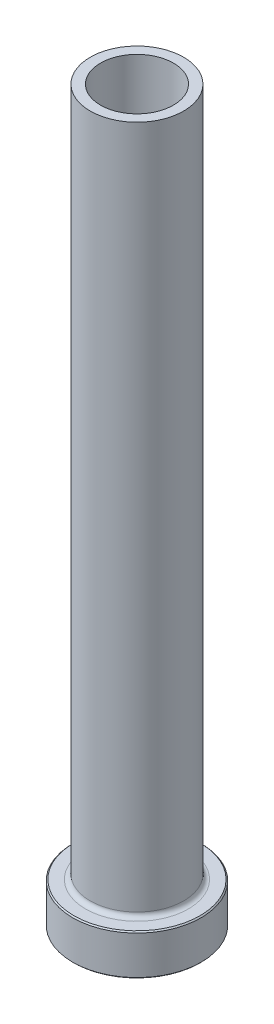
ISO-10303-21;
HEADER;
FILE_DESCRIPTION(('STEP AP214'),'2;1');
FILE_NAME('part.step','',(''),(''),'','','');
FILE_SCHEMA(('AUTOMOTIVE_DESIGN { 1 0 10303 214 1 1 1 1 }'));
ENDSEC;
DATA;
#1=APPLICATION_CONTEXT('core data for automotive mechanical design processes');
#2=APPLICATION_PROTOCOL_DEFINITION('international standard','automotive_design',2000,#1);
#3=PRODUCT_CONTEXT('',#1,'mechanical');
#4=PRODUCT('Part','Part','',(#3));
#5=PRODUCT_RELATED_PRODUCT_CATEGORY('part','',(#4));
#6=PRODUCT_DEFINITION_FORMATION('','',#4);
#7=PRODUCT_DEFINITION_CONTEXT('part definition',#1,'design');
#8=PRODUCT_DEFINITION('design','',#6,#7);
#9=PRODUCT_DEFINITION_SHAPE('','',#8);
#10=(LENGTH_UNIT() NAMED_UNIT(*) SI_UNIT(.MILLI.,.METRE.));
#11=(NAMED_UNIT(*) PLANE_ANGLE_UNIT() SI_UNIT($,.RADIAN.));
#12=(NAMED_UNIT(*) SI_UNIT($,.STERADIAN.) SOLID_ANGLE_UNIT());
#13=UNCERTAINTY_MEASURE_WITH_UNIT(LENGTH_MEASURE(1.E-05),#10,'distance_accuracy_value','');
#14=(GEOMETRIC_REPRESENTATION_CONTEXT(3) GLOBAL_UNCERTAINTY_ASSIGNED_CONTEXT((#13)) GLOBAL_UNIT_ASSIGNED_CONTEXT((#10,
#11,#12)) REPRESENTATION_CONTEXT('',''));
#15=CARTESIAN_POINT('',(0.,0.,0.));
#16=DIRECTION('',(0.,0.,1.));
#17=DIRECTION('',(1.,0.,0.));
#18=AXIS2_PLACEMENT_3D('',#15,#16,#17);
#19=CARTESIAN_POINT('',(0.,92.1876809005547,0.));
#20=DIRECTION('',(0.,1.,0.));
#21=DIRECTION('',(0.,0.,1.));
#22=AXIS2_PLACEMENT_3D('',#19,#20,#21);
#23=CYLINDRICAL_SURFACE('',#22,6.24999999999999);
#24=CARTESIAN_POINT('',(0.,125.,0.));
#25=DIRECTION('',(0.,1.,0.));
#26=DIRECTION('',(0.,0.,1.));
#27=AXIS2_PLACEMENT_3D('',#24,#25,#26);
#28=CIRCLE('',#27,6.24999999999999);
#29=CARTESIAN_POINT('',(0.,125.,6.24999999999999));
#30=VERTEX_POINT('',#29);
#31=EDGE_CURVE('E62',#30,#30,#28,.T.);
#32=ORIENTED_EDGE('',*,*,#31,.T.);
#33=EDGE_LOOP('',(#32));
#34=FACE_BOUND('',#33,.T.);
#35=CARTESIAN_POINT('',(0.,70.,0.));
#36=DIRECTION('',(0.,1.,0.));
#37=DIRECTION('',(0.,0.,1.));
#38=AXIS2_PLACEMENT_3D('',#35,#36,#37);
#39=CIRCLE('',#38,6.24999999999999);
#40=CARTESIAN_POINT('',(0.,70.,6.24999999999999));
#41=VERTEX_POINT('',#40);
#42=EDGE_CURVE('E71',#41,#41,#39,.T.);
#43=ORIENTED_EDGE('',*,*,#42,.F.);
#44=EDGE_LOOP('',(#43));
#45=FACE_BOUND('',#44,.T.);
#46=ADVANCED_FACE('F30',(#34,#45),#23,.F.);
#47=CARTESIAN_POINT('',(-6.24999999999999,125.,0.));
#48=DIRECTION('',(0.,1.,0.));
#49=DIRECTION('',(0.,0.,1.));
#50=AXIS2_PLACEMENT_3D('',#47,#48,#49);
#51=PLANE('',#50);
#52=CARTESIAN_POINT('',(0.,125.,0.));
#53=DIRECTION('',(0.,1.,0.));
#54=DIRECTION('',(0.,0.,1.));
#55=AXIS2_PLACEMENT_3D('',#52,#53,#54);
#56=CIRCLE('',#55,8.);
#57=CARTESIAN_POINT('',(0.,125.,8.));
#58=VERTEX_POINT('',#57);
#59=EDGE_CURVE('E65',#58,#58,#56,.T.);
#60=ORIENTED_EDGE('',*,*,#59,.T.);
#61=EDGE_LOOP('',(#60));
#62=FACE_BOUND('',#61,.T.);
#63=ORIENTED_EDGE('',*,*,#31,.F.);
#64=EDGE_LOOP('',(#63));
#65=FACE_BOUND('',#64,.T.);
#66=ADVANCED_FACE('F79',(#62,#65),#51,.T.);
#67=CARTESIAN_POINT('',(0.,92.1876809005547,0.));
#68=DIRECTION('',(0.,1.,0.));
#69=DIRECTION('',(0.,0.,1.));
#70=AXIS2_PLACEMENT_3D('',#67,#68,#69);
#71=CYLINDRICAL_SURFACE('',#70,8.);
#72=CARTESIAN_POINT('',(0.,7.8,0.));
#73=DIRECTION('',(0.,1.,0.));
#74=DIRECTION('',(0.,0.,1.));
#75=AXIS2_PLACEMENT_3D('',#72,#73,#74);
#76=CIRCLE('',#75,8.);
#77=CARTESIAN_POINT('',(0.,7.8,8.));
#78=VERTEX_POINT('',#77);
#79=EDGE_CURVE('E59',#78,#78,#76,.T.);
#80=ORIENTED_EDGE('',*,*,#79,.T.);
#81=EDGE_LOOP('',(#80));
#82=FACE_BOUND('',#81,.T.);
#83=ORIENTED_EDGE('',*,*,#59,.F.);
#84=EDGE_LOOP('',(#83));
#85=FACE_BOUND('',#84,.T.);
#86=ADVANCED_FACE('F85',(#82,#85),#71,.T.);
#87=CARTESIAN_POINT('',(-7.99999999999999,7.,0.));
#88=DIRECTION('',(0.,1.,0.));
#89=DIRECTION('',(0.,0.,1.));
#90=AXIS2_PLACEMENT_3D('',#87,#88,#89);
#91=PLANE('',#90);
#92=CARTESIAN_POINT('',(0.,7.,0.));
#93=DIRECTION('',(0.,1.,0.));
#94=DIRECTION('',(0.,0.,1.));
#95=AXIS2_PLACEMENT_3D('',#92,#93,#94);
#96=CIRCLE('',#95,10.8);
#97=CARTESIAN_POINT('',(0.,7.,10.8));
#98=VERTEX_POINT('',#97);
#99=EDGE_CURVE('E53',#98,#98,#96,.T.);
#100=ORIENTED_EDGE('',*,*,#99,.T.);
#101=EDGE_LOOP('',(#100));
#102=FACE_BOUND('',#101,.T.);
#103=CARTESIAN_POINT('',(0.,7.,0.));
#104=DIRECTION('',(0.,1.,0.));
#105=DIRECTION('',(0.,0.,1.));
#106=AXIS2_PLACEMENT_3D('',#103,#104,#105);
#107=CIRCLE('',#106,8.8);
#108=CARTESIAN_POINT('',(0.,7.,8.8));
#109=VERTEX_POINT('',#108);
#110=EDGE_CURVE('E56',#109,#109,#107,.F.);
#111=ORIENTED_EDGE('',*,*,#110,.T.);
#112=EDGE_LOOP('',(#111));
#113=FACE_BOUND('',#112,.T.);
#114=ADVANCED_FACE('F111',(#102,#113),#91,.T.);
#115=CARTESIAN_POINT('',(0.,92.1876809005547,0.));
#116=DIRECTION('',(0.,1.,0.));
#117=DIRECTION('',(0.,0.,1.));
#118=AXIS2_PLACEMENT_3D('',#115,#116,#117);
#119=CYLINDRICAL_SURFACE('',#118,11.);
#120=CARTESIAN_POINT('',(0.,6.80000000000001,0.));
#121=DIRECTION('',(0.,1.,0.));
#122=DIRECTION('',(0.,0.,1.));
#123=AXIS2_PLACEMENT_3D('',#120,#121,#122);
#124=CIRCLE('',#123,11.);
#125=CARTESIAN_POINT('',(0.,6.80000000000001,11.));
#126=VERTEX_POINT('',#125);
#127=EDGE_CURVE('E45',#126,#126,#124,.F.);
#128=ORIENTED_EDGE('',*,*,#127,.T.);
#129=EDGE_LOOP('',(#128));
#130=FACE_BOUND('',#129,.T.);
#131=CARTESIAN_POINT('',(0.,0.20000000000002,0.));
#132=DIRECTION('',(0.,-1.,0.));
#133=DIRECTION('',(0.,0.,-1.));
#134=AXIS2_PLACEMENT_3D('',#131,#132,#133);
#135=CIRCLE('',#134,11.);
#136=CARTESIAN_POINT('',(0.,0.20000000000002,-11.));
#137=VERTEX_POINT('',#136);
#138=EDGE_CURVE('E50',#137,#137,#135,.F.);
#139=ORIENTED_EDGE('',*,*,#138,.T.);
#140=EDGE_LOOP('',(#139));
#141=FACE_BOUND('',#140,.T.);
#142=ADVANCED_FACE('F108',(#130,#141),#119,.T.);
#143=CARTESIAN_POINT('',(-11.,0.,0.));
#144=DIRECTION('',(0.,-1.,0.));
#145=DIRECTION('',(0.,0.,-1.));
#146=AXIS2_PLACEMENT_3D('',#143,#144,#145);
#147=PLANE('',#146);
#148=CARTESIAN_POINT('',(0.,0.,0.));
#149=DIRECTION('',(0.,-1.,0.));
#150=DIRECTION('',(0.,0.,-1.));
#151=AXIS2_PLACEMENT_3D('',#148,#149,#150);
#152=CIRCLE('',#151,6.99999999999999);
#153=CARTESIAN_POINT('',(0.,0.,-6.99999999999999));
#154=VERTEX_POINT('',#153);
#155=EDGE_CURVE('E37',#154,#154,#152,.F.);
#156=ORIENTED_EDGE('',*,*,#155,.T.);
#157=EDGE_LOOP('',(#156));
#158=FACE_BOUND('',#157,.T.);
#159=CARTESIAN_POINT('',(0.,0.,0.));
#160=DIRECTION('',(0.,-1.,0.));
#161=DIRECTION('',(0.,0.,-1.));
#162=AXIS2_PLACEMENT_3D('',#159,#160,#161);
#163=CIRCLE('',#162,10.8);
#164=CARTESIAN_POINT('',(0.,0.,-10.8));
#165=VERTEX_POINT('',#164);
#166=EDGE_CURVE('E41',#165,#165,#163,.T.);
#167=ORIENTED_EDGE('',*,*,#166,.T.);
#168=EDGE_LOOP('',(#167));
#169=FACE_BOUND('',#168,.T.);
#170=ADVANCED_FACE('F110',(#158,#169),#147,.T.);
#171=CARTESIAN_POINT('',(0.,92.1876809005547,0.));
#172=DIRECTION('',(0.,1.,0.));
#173=DIRECTION('',(0.,0.,1.));
#174=AXIS2_PLACEMENT_3D('',#171,#172,#173);
#175=CYLINDRICAL_SURFACE('',#174,6.49999999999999);
#176=CARTESIAN_POINT('',(0.,0.5,0.));
#177=DIRECTION('',(0.,-1.,0.));
#178=DIRECTION('',(0.,0.,-1.));
#179=AXIS2_PLACEMENT_3D('',#176,#177,#178);
#180=CIRCLE('',#179,6.49999999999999);
#181=CARTESIAN_POINT('',(0.,0.5,-6.49999999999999));
#182=VERTEX_POINT('',#181);
#183=EDGE_CURVE('E10',#182,#182,#180,.T.);
#184=ORIENTED_EDGE('',*,*,#183,.T.);
#185=EDGE_LOOP('',(#184));
#186=FACE_BOUND('',#185,.T.);
#187=CARTESIAN_POINT('',(0.,58.,0.));
#188=DIRECTION('',(0.,1.,0.));
#189=DIRECTION('',(0.,0.,1.));
#190=AXIS2_PLACEMENT_3D('',#187,#188,#189);
#191=CIRCLE('',#190,6.5);
#192=CARTESIAN_POINT('',(0.,58.,6.5));
#193=VERTEX_POINT('',#192);
#194=EDGE_CURVE('E68',#193,#193,#191,.T.);
#195=ORIENTED_EDGE('',*,*,#194,.T.);
#196=EDGE_LOOP('',(#195));
#197=FACE_BOUND('',#196,.T.);
#198=ADVANCED_FACE('F118',(#186,#197),#175,.F.);
#199=CARTESIAN_POINT('',(0.,58.,0.));
#200=DIRECTION('',(0.,-1.,0.));
#201=DIRECTION('',(0.,0.,-1.));
#202=AXIS2_PLACEMENT_3D('',#199,#200,#201);
#203=CONICAL_SURFACE('',#202,6.5,0.0208303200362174);
#204=ORIENTED_EDGE('',*,*,#42,.T.);
#205=EDGE_LOOP('',(#204));
#206=FACE_BOUND('',#205,.T.);
#207=ORIENTED_EDGE('',*,*,#194,.F.);
#208=EDGE_LOOP('',(#207));
#209=FACE_BOUND('',#208,.T.);
#210=ADVANCED_FACE('F75',(#206,#209),#203,.F.);
#211=CARTESIAN_POINT('',(0.,7.8,0.));
#212=DIRECTION('',(0.,1.,0.));
#213=DIRECTION('',(0.,0.,1.));
#214=AXIS2_PLACEMENT_3D('',#211,#212,#213);
#215=TOROIDAL_SURFACE('',#214,8.8,0.8);
#216=ORIENTED_EDGE('',*,*,#110,.F.);
#217=EDGE_LOOP('',(#216));
#218=FACE_BOUND('',#217,.T.);
#219=ORIENTED_EDGE('',*,*,#79,.F.);
#220=EDGE_LOOP('',(#219));
#221=FACE_BOUND('',#220,.T.);
#222=ADVANCED_FACE('F90',(#218,#221),#215,.F.);
#223=CARTESIAN_POINT('',(0.,7.00000000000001,0.));
#224=DIRECTION('',(0.,-1.,0.));
#225=DIRECTION('',(0.,0.,-1.));
#226=AXIS2_PLACEMENT_3D('',#223,#224,#225);
#227=CONICAL_SURFACE('',#226,10.8,0.785398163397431);
#228=ORIENTED_EDGE('',*,*,#127,.F.);
#229=EDGE_LOOP('',(#228));
#230=FACE_BOUND('',#229,.T.);
#231=ORIENTED_EDGE('',*,*,#99,.F.);
#232=EDGE_LOOP('',(#231));
#233=FACE_BOUND('',#232,.T.);
#234=ADVANCED_FACE('F93',(#230,#233),#227,.T.);
#235=CARTESIAN_POINT('',(0.,0.20000000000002,0.));
#236=DIRECTION('',(0.,1.,0.));
#237=DIRECTION('',(0.,0.,1.));
#238=AXIS2_PLACEMENT_3D('',#235,#236,#237);
#239=CONICAL_SURFACE('',#238,11.,0.785398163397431);
#240=ORIENTED_EDGE('',*,*,#166,.F.);
#241=EDGE_LOOP('',(#240));
#242=FACE_BOUND('',#241,.T.);
#243=ORIENTED_EDGE('',*,*,#138,.F.);
#244=EDGE_LOOP('',(#243));
#245=FACE_BOUND('',#244,.T.);
#246=ADVANCED_FACE('F96',(#242,#245),#239,.T.);
#247=CARTESIAN_POINT('',(0.,0.,0.));
#248=DIRECTION('',(0.,-1.,0.));
#249=DIRECTION('',(0.,0.,-1.));
#250=AXIS2_PLACEMENT_3D('',#247,#248,#249);
#251=CONICAL_SURFACE('',#250,6.99999999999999,0.785398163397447);
#252=ORIENTED_EDGE('',*,*,#183,.F.);
#253=EDGE_LOOP('',(#252));
#254=FACE_BOUND('',#253,.T.);
#255=ORIENTED_EDGE('',*,*,#155,.F.);
#256=EDGE_LOOP('',(#255));
#257=FACE_BOUND('',#256,.T.);
#258=ADVANCED_FACE('F32',(#254,#257),#251,.F.);
#259=CLOSED_SHELL('',(#46,#66,#86,#114,#142,#170,#198,#210,#222,#234,#246,#258));
#260=MANIFOLD_SOLID_BREP('B2',#259);
#261=ADVANCED_BREP_SHAPE_REPRESENTATION('',(#18,#260),#14);
#262=SHAPE_DEFINITION_REPRESENTATION(#9,#261);
ENDSEC;
END-ISO-10303-21;
